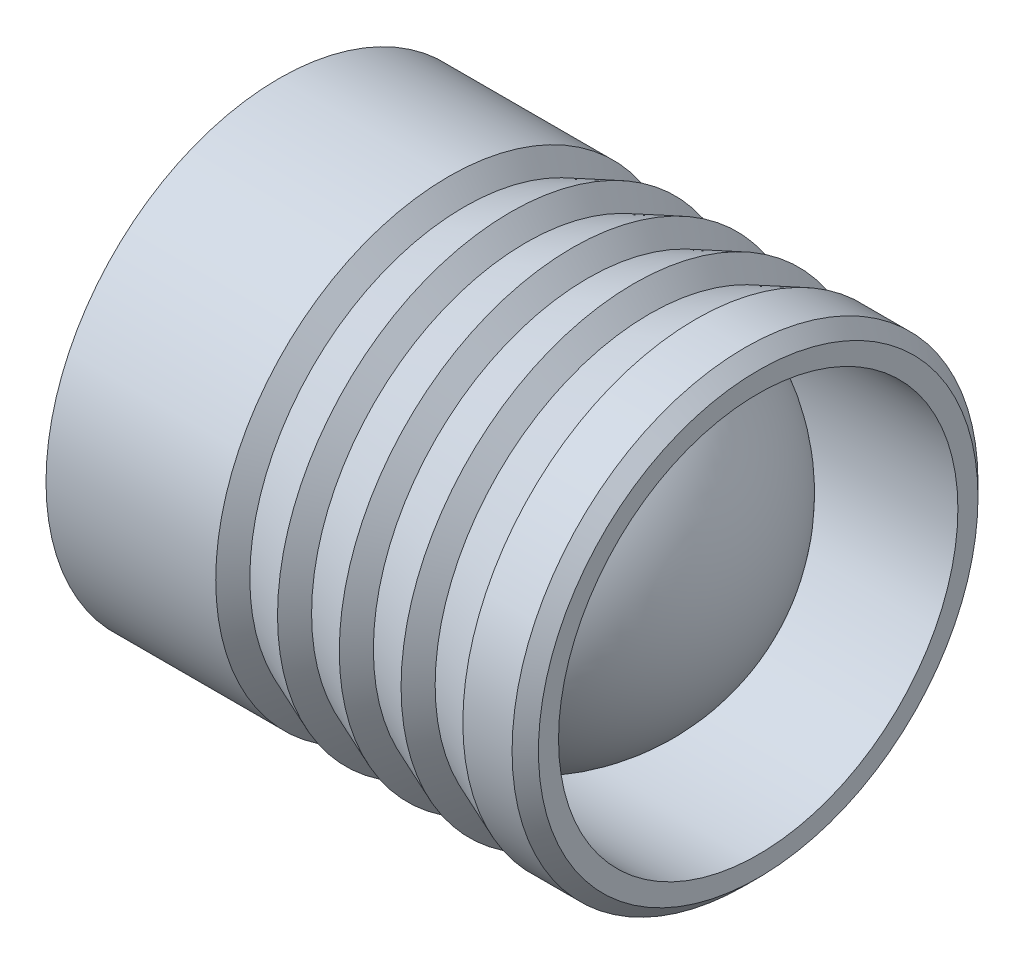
ISO-10303-21;
HEADER;
FILE_DESCRIPTION(('STEP AP214'),'2;1');
FILE_NAME('part.step','',(''),(''),'','','');
FILE_SCHEMA(('AUTOMOTIVE_DESIGN { 1 0 10303 214 1 1 1 1 }'));
ENDSEC;
DATA;
#1=APPLICATION_CONTEXT('core data for automotive mechanical design processes');
#2=APPLICATION_PROTOCOL_DEFINITION('international standard','automotive_design',2000,#1);
#3=PRODUCT_CONTEXT('',#1,'mechanical');
#4=PRODUCT('Part','Part','',(#3));
#5=PRODUCT_RELATED_PRODUCT_CATEGORY('part','',(#4));
#6=PRODUCT_DEFINITION_FORMATION('','',#4);
#7=PRODUCT_DEFINITION_CONTEXT('part definition',#1,'design');
#8=PRODUCT_DEFINITION('design','',#6,#7);
#9=PRODUCT_DEFINITION_SHAPE('','',#8);
#10=(LENGTH_UNIT() NAMED_UNIT(*) SI_UNIT(.MILLI.,.METRE.));
#11=(NAMED_UNIT(*) PLANE_ANGLE_UNIT() SI_UNIT($,.RADIAN.));
#12=(NAMED_UNIT(*) SI_UNIT($,.STERADIAN.) SOLID_ANGLE_UNIT());
#13=UNCERTAINTY_MEASURE_WITH_UNIT(LENGTH_MEASURE(1.E-05),#10,'distance_accuracy_value','');
#14=(GEOMETRIC_REPRESENTATION_CONTEXT(3) GLOBAL_UNCERTAINTY_ASSIGNED_CONTEXT((#13)) GLOBAL_UNIT_ASSIGNED_CONTEXT((#10,
#11,#12)) REPRESENTATION_CONTEXT('',''));
#15=CARTESIAN_POINT('',(0.,0.,0.));
#16=DIRECTION('',(0.,0.,1.));
#17=DIRECTION('',(1.,0.,0.));
#18=AXIS2_PLACEMENT_3D('',#15,#16,#17);
#19=CARTESIAN_POINT('',(4.09,0.,0.));
#20=DIRECTION('',(1.,0.,0.));
#21=DIRECTION('',(0.,-1.,0.));
#22=AXIS2_PLACEMENT_3D('',#19,#20,#21);
#23=SPHERICAL_SURFACE('',#22,3.01);
#24=CARTESIAN_POINT('',(4.33515423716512,0.,0.));
#25=DIRECTION('',(-1.,0.,0.));
#26=DIRECTION('',(0.,0.,1.));
#27=AXIS2_PLACEMENT_3D('',#24,#25,#26);
#28=CIRCLE('',#27,2.9999999);
#29=CARTESIAN_POINT('',(4.33515423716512,0.,2.9999999));
#30=VERTEX_POINT('',#29);
#31=EDGE_CURVE('E41',#30,#30,#28,.T.);
#32=ORIENTED_EDGE('',*,*,#31,.F.);
#33=EDGE_LOOP('',(#32));
#34=FACE_BOUND('',#33,.T.);
#35=CARTESIAN_POINT('',(7.1,0.,0.));
#36=VERTEX_POINT('',#35);
#37=VERTEX_LOOP('',#36);
#38=FACE_BOUND('',#37,.T.);
#39=ADVANCED_FACE('F18',(#34,#38),#23,.T.);
#40=CARTESIAN_POINT('',(7.5,3.30201010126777,0.));
#41=DIRECTION('',(-1.,0.,0.));
#42=DIRECTION('',(0.,0.,1.));
#43=AXIS2_PLACEMENT_3D('',#40,#41,#42);
#44=PLANE('',#43);
#45=CARTESIAN_POINT('',(7.5,0.,0.));
#46=DIRECTION('',(1.,0.,0.));
#47=DIRECTION('',(0.,0.,-1.));
#48=AXIS2_PLACEMENT_3D('',#45,#46,#47);
#49=CIRCLE('',#48,3.3020101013);
#50=CARTESIAN_POINT('',(7.5,0.,-3.30201010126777));
#51=VERTEX_POINT('',#50);
#52=EDGE_CURVE('E11',#51,#51,#49,.T.);
#53=ORIENTED_EDGE('',*,*,#52,.T.);
#54=EDGE_LOOP('',(#53));
#55=FACE_BOUND('',#54,.T.);
#56=CARTESIAN_POINT('',(7.5,0.,0.));
#57=DIRECTION('',(1.,0.,0.));
#58=DIRECTION('',(0.,0.,-1.));
#59=AXIS2_PLACEMENT_3D('',#56,#57,#58);
#60=CIRCLE('',#59,2.9999999);
#61=CARTESIAN_POINT('',(7.5,0.,-2.99999989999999));
#62=VERTEX_POINT('',#61);
#63=EDGE_CURVE('E29',#62,#62,#60,.T.);
#64=ORIENTED_EDGE('',*,*,#63,.F.);
#65=EDGE_LOOP('',(#64));
#66=FACE_BOUND('',#65,.T.);
#67=ADVANCED_FACE('F270',(#55,#66),#44,.F.);
#68=CARTESIAN_POINT('',(7.5,0.,0.));
#69=DIRECTION('',(-1.,0.,0.));
#70=DIRECTION('',(0.,0.,-1.));
#71=AXIS2_PLACEMENT_3D('',#68,#69,#70);
#72=CYLINDRICAL_SURFACE('',#71,2.9999999);
#73=ORIENTED_EDGE('',*,*,#63,.T.);
#74=EDGE_LOOP('',(#73));
#75=FACE_BOUND('',#74,.T.);
#76=ORIENTED_EDGE('',*,*,#31,.T.);
#77=EDGE_LOOP('',(#76));
#78=FACE_BOUND('',#77,.T.);
#79=ADVANCED_FACE('F261',(#75,#78),#72,.F.);
#80=CARTESIAN_POINT('',(0.,0.,0.));
#81=DIRECTION('',(1.,0.,0.));
#82=DIRECTION('',(0.,1.,0.));
#83=AXIS2_PLACEMENT_3D('',#80,#81,#82);
#84=PLANE('',#83);
#85=CARTESIAN_POINT('',(0.,0.,0.));
#86=DIRECTION('',(1.,0.,0.));
#87=DIRECTION('',(0.,0.,-1.));
#88=AXIS2_PLACEMENT_3D('',#85,#86,#87);
#89=CIRCLE('',#88,2.9803847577);
#90=CARTESIAN_POINT('',(0.,0.,-2.98038475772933));
#91=VERTEX_POINT('',#90);
#92=EDGE_CURVE('E144',#91,#91,#89,.T.);
#93=ORIENTED_EDGE('',*,*,#92,.F.);
#94=EDGE_LOOP('',(#93));
#95=FACE_BOUND('',#94,.T.);
#96=ADVANCED_FACE('F258',(#95),#84,.F.);
#97=CARTESIAN_POINT('',(7.30201010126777,0.,0.));
#98=DIRECTION('',(-1.,0.,0.));
#99=DIRECTION('',(0.,0.,1.));
#100=AXIS2_PLACEMENT_3D('',#97,#98,#99);
#101=CONICAL_SURFACE('',#100,3.5,0.7853981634);
#102=CARTESIAN_POINT('',(7.30201010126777,0.,0.));
#103=DIRECTION('',(1.,0.,0.));
#104=DIRECTION('',(0.,0.,-1.));
#105=AXIS2_PLACEMENT_3D('',#102,#103,#104);
#106=CIRCLE('',#105,3.5);
#107=CARTESIAN_POINT('',(7.30201010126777,0.,-3.5));
#108=VERTEX_POINT('',#107);
#109=EDGE_CURVE('E130',#108,#108,#106,.T.);
#110=ORIENTED_EDGE('',*,*,#109,.T.);
#111=EDGE_LOOP('',(#110));
#112=FACE_BOUND('',#111,.T.);
#113=ORIENTED_EDGE('',*,*,#52,.F.);
#114=EDGE_LOOP('',(#113));
#115=FACE_BOUND('',#114,.T.);
#116=ADVANCED_FACE('F254',(#112,#115),#101,.T.);
#117=CARTESIAN_POINT('',(7.5,0.,0.));
#118=DIRECTION('',(-1.,0.,0.));
#119=DIRECTION('',(0.,0.,-1.));
#120=AXIS2_PLACEMENT_3D('',#117,#118,#119);
#121=CYLINDRICAL_SURFACE('',#120,3.5);
#122=CARTESIAN_POINT('',(6.5625,0.,0.));
#123=DIRECTION('',(1.,0.,0.));
#124=DIRECTION('',(0.,0.,-1.));
#125=AXIS2_PLACEMENT_3D('',#122,#123,#124);
#126=CIRCLE('',#125,3.5);
#127=CARTESIAN_POINT('',(6.5625,0.,-3.5));
#128=VERTEX_POINT('',#127);
#129=EDGE_CURVE('E174',#128,#128,#126,.T.);
#130=ORIENTED_EDGE('',*,*,#129,.T.);
#131=EDGE_LOOP('',(#130));
#132=FACE_BOUND('',#131,.T.);
#133=ORIENTED_EDGE('',*,*,#109,.F.);
#134=EDGE_LOOP('',(#133));
#135=FACE_BOUND('',#134,.T.);
#136=ADVANCED_FACE('F257',(#132,#135),#121,.T.);
#137=CARTESIAN_POINT('',(5.86640625,0.,0.));
#138=DIRECTION('',(1.,0.,0.));
#139=DIRECTION('',(0.,0.,-1.));
#140=AXIS2_PLACEMENT_3D('',#137,#138,#139);
#141=CONICAL_SURFACE('',#140,3.22,0.3824399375);
#142=ORIENTED_EDGE('',*,*,#129,.F.);
#143=EDGE_LOOP('',(#142));
#144=FACE_BOUND('',#143,.T.);
#145=CARTESIAN_POINT('',(5.86640625,0.,0.));
#146=DIRECTION('',(1.,0.,0.));
#147=DIRECTION('',(0.,0.,-1.));
#148=AXIS2_PLACEMENT_3D('',#145,#146,#147);
#149=CIRCLE('',#148,3.22);
#150=CARTESIAN_POINT('',(5.86640625,0.,-3.22));
#151=VERTEX_POINT('',#150);
#152=EDGE_CURVE('E124',#151,#151,#149,.T.);
#153=ORIENTED_EDGE('',*,*,#152,.T.);
#154=EDGE_LOOP('',(#153));
#155=FACE_BOUND('',#154,.T.);
#156=ADVANCED_FACE('F265',(#144,#155),#141,.T.);
#157=CARTESIAN_POINT('',(5.634375,0.,0.));
#158=DIRECTION('',(-1.,0.,0.));
#159=DIRECTION('',(0.,0.,1.));
#160=AXIS2_PLACEMENT_3D('',#157,#158,#159);
#161=CONICAL_SURFACE('',#160,3.5,0.8788087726);
#162=CARTESIAN_POINT('',(5.634375,0.,0.));
#163=DIRECTION('',(1.,0.,0.));
#164=DIRECTION('',(0.,0.,-1.));
#165=AXIS2_PLACEMENT_3D('',#162,#163,#164);
#166=CIRCLE('',#165,3.5);
#167=CARTESIAN_POINT('',(5.634375,0.,-3.5));
#168=VERTEX_POINT('',#167);
#169=EDGE_CURVE('E22',#168,#168,#166,.T.);
#170=ORIENTED_EDGE('',*,*,#169,.T.);
#171=EDGE_LOOP('',(#170));
#172=FACE_BOUND('',#171,.T.);
#173=ORIENTED_EDGE('',*,*,#152,.F.);
#174=EDGE_LOOP('',(#173));
#175=FACE_BOUND('',#174,.T.);
#176=ADVANCED_FACE('F268',(#172,#175),#161,.T.);
#177=CARTESIAN_POINT('',(4.93828125,0.,0.));
#178=DIRECTION('',(1.,0.,0.));
#179=DIRECTION('',(0.,0.,-1.));
#180=AXIS2_PLACEMENT_3D('',#177,#178,#179);
#181=CONICAL_SURFACE('',#180,3.22,0.3824399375);
#182=ORIENTED_EDGE('',*,*,#169,.F.);
#183=EDGE_LOOP('',(#182));
#184=FACE_BOUND('',#183,.T.);
#185=CARTESIAN_POINT('',(4.93828125,0.,0.));
#186=DIRECTION('',(1.,0.,0.));
#187=DIRECTION('',(0.,0.,-1.));
#188=AXIS2_PLACEMENT_3D('',#185,#186,#187);
#189=CIRCLE('',#188,3.22);
#190=CARTESIAN_POINT('',(4.93828125,0.,-3.22));
#191=VERTEX_POINT('',#190);
#192=EDGE_CURVE('E113',#191,#191,#189,.T.);
#193=ORIENTED_EDGE('',*,*,#192,.T.);
#194=EDGE_LOOP('',(#193));
#195=FACE_BOUND('',#194,.T.);
#196=ADVANCED_FACE('F299',(#184,#195),#181,.T.);
#197=CARTESIAN_POINT('',(4.70625,0.,0.));
#198=DIRECTION('',(-1.,0.,0.));
#199=DIRECTION('',(0.,0.,1.));
#200=AXIS2_PLACEMENT_3D('',#197,#198,#199);
#201=CONICAL_SURFACE('',#200,3.5,0.8788087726);
#202=CARTESIAN_POINT('',(4.70625,0.,0.));
#203=DIRECTION('',(1.,0.,0.));
#204=DIRECTION('',(0.,0.,-1.));
#205=AXIS2_PLACEMENT_3D('',#202,#203,#204);
#206=CIRCLE('',#205,3.5);
#207=CARTESIAN_POINT('',(4.70625,0.,-3.5));
#208=VERTEX_POINT('',#207);
#209=EDGE_CURVE('E117',#208,#208,#206,.T.);
#210=ORIENTED_EDGE('',*,*,#209,.T.);
#211=EDGE_LOOP('',(#210));
#212=FACE_BOUND('',#211,.T.);
#213=ORIENTED_EDGE('',*,*,#192,.F.);
#214=EDGE_LOOP('',(#213));
#215=FACE_BOUND('',#214,.T.);
#216=ADVANCED_FACE('F114',(#212,#215),#201,.T.);
#217=CARTESIAN_POINT('',(4.01015625,0.,0.));
#218=DIRECTION('',(1.,0.,0.));
#219=DIRECTION('',(0.,0.,-1.));
#220=AXIS2_PLACEMENT_3D('',#217,#218,#219);
#221=CONICAL_SURFACE('',#220,3.22,0.3824399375);
#222=ORIENTED_EDGE('',*,*,#209,.F.);
#223=EDGE_LOOP('',(#222));
#224=FACE_BOUND('',#223,.T.);
#225=CARTESIAN_POINT('',(4.01015625,0.,0.));
#226=DIRECTION('',(1.,0.,0.));
#227=DIRECTION('',(0.,0.,-1.));
#228=AXIS2_PLACEMENT_3D('',#225,#226,#227);
#229=CIRCLE('',#228,3.22);
#230=CARTESIAN_POINT('',(4.01015625,0.,-3.22));
#231=VERTEX_POINT('',#230);
#232=EDGE_CURVE('E127',#231,#231,#229,.T.);
#233=ORIENTED_EDGE('',*,*,#232,.T.);
#234=EDGE_LOOP('',(#233));
#235=FACE_BOUND('',#234,.T.);
#236=ADVANCED_FACE('F295',(#224,#235),#221,.T.);
#237=CARTESIAN_POINT('',(3.778125,0.,0.));
#238=DIRECTION('',(-1.,0.,0.));
#239=DIRECTION('',(0.,0.,1.));
#240=AXIS2_PLACEMENT_3D('',#237,#238,#239);
#241=CONICAL_SURFACE('',#240,3.5,0.8788087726);
#242=CARTESIAN_POINT('',(3.778125,0.,0.));
#243=DIRECTION('',(1.,0.,0.));
#244=DIRECTION('',(0.,0.,-1.));
#245=AXIS2_PLACEMENT_3D('',#242,#243,#244);
#246=CIRCLE('',#245,3.5);
#247=CARTESIAN_POINT('',(3.778125,0.,-3.5));
#248=VERTEX_POINT('',#247);
#249=EDGE_CURVE('E140',#248,#248,#246,.T.);
#250=ORIENTED_EDGE('',*,*,#249,.T.);
#251=EDGE_LOOP('',(#250));
#252=FACE_BOUND('',#251,.T.);
#253=ORIENTED_EDGE('',*,*,#232,.F.);
#254=EDGE_LOOP('',(#253));
#255=FACE_BOUND('',#254,.T.);
#256=ADVANCED_FACE('F293',(#252,#255),#241,.T.);
#257=CARTESIAN_POINT('',(3.08203125,0.,0.));
#258=DIRECTION('',(1.,0.,0.));
#259=DIRECTION('',(0.,0.,-1.));
#260=AXIS2_PLACEMENT_3D('',#257,#258,#259);
#261=CONICAL_SURFACE('',#260,3.22,0.3824399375);
#262=ORIENTED_EDGE('',*,*,#249,.F.);
#263=EDGE_LOOP('',(#262));
#264=FACE_BOUND('',#263,.T.);
#265=CARTESIAN_POINT('',(3.08203125,0.,0.));
#266=DIRECTION('',(1.,0.,0.));
#267=DIRECTION('',(0.,0.,-1.));
#268=AXIS2_PLACEMENT_3D('',#265,#266,#267);
#269=CIRCLE('',#268,3.22);
#270=CARTESIAN_POINT('',(3.08203125,0.,-3.22));
#271=VERTEX_POINT('',#270);
#272=EDGE_CURVE('E134',#271,#271,#269,.T.);
#273=ORIENTED_EDGE('',*,*,#272,.T.);
#274=EDGE_LOOP('',(#273));
#275=FACE_BOUND('',#274,.T.);
#276=ADVANCED_FACE('F283',(#264,#275),#261,.T.);
#277=CARTESIAN_POINT('',(2.85,0.,0.));
#278=DIRECTION('',(-1.,0.,0.));
#279=DIRECTION('',(0.,0.,1.));
#280=AXIS2_PLACEMENT_3D('',#277,#278,#279);
#281=CONICAL_SURFACE('',#280,3.5,0.8788087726);
#282=CARTESIAN_POINT('',(2.85,0.,0.));
#283=DIRECTION('',(1.,0.,0.));
#284=DIRECTION('',(0.,0.,-1.));
#285=AXIS2_PLACEMENT_3D('',#282,#283,#284);
#286=CIRCLE('',#285,3.5);
#287=CARTESIAN_POINT('',(2.85,0.,-3.5));
#288=VERTEX_POINT('',#287);
#289=EDGE_CURVE('E132',#288,#288,#286,.T.);
#290=ORIENTED_EDGE('',*,*,#289,.T.);
#291=EDGE_LOOP('',(#290));
#292=FACE_BOUND('',#291,.T.);
#293=ORIENTED_EDGE('',*,*,#272,.F.);
#294=EDGE_LOOP('',(#293));
#295=FACE_BOUND('',#294,.T.);
#296=ADVANCED_FACE('F276',(#292,#295),#281,.T.);
#297=CARTESIAN_POINT('',(7.5,0.,0.));
#298=DIRECTION('',(-1.,0.,0.));
#299=DIRECTION('',(0.,0.,-1.));
#300=AXIS2_PLACEMENT_3D('',#297,#298,#299);
#301=CYLINDRICAL_SURFACE('',#300,3.5);
#302=CARTESIAN_POINT('',(0.3,0.,0.));
#303=DIRECTION('',(1.,0.,0.));
#304=DIRECTION('',(0.,0.,-1.));
#305=AXIS2_PLACEMENT_3D('',#302,#303,#304);
#306=CIRCLE('',#305,3.5);
#307=CARTESIAN_POINT('',(0.3,0.,-3.5));
#308=VERTEX_POINT('',#307);
#309=EDGE_CURVE('E135',#308,#308,#306,.T.);
#310=ORIENTED_EDGE('',*,*,#309,.T.);
#311=EDGE_LOOP('',(#310));
#312=FACE_BOUND('',#311,.T.);
#313=ORIENTED_EDGE('',*,*,#289,.F.);
#314=EDGE_LOOP('',(#313));
#315=FACE_BOUND('',#314,.T.);
#316=ADVANCED_FACE('F273',(#312,#315),#301,.T.);
#317=CARTESIAN_POINT('',(0.,0.,0.));
#318=DIRECTION('',(1.,0.,0.));
#319=DIRECTION('',(0.,0.,-1.));
#320=AXIS2_PLACEMENT_3D('',#317,#318,#319);
#321=CONICAL_SURFACE('',#320,2.9803847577,1.0471975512);
#322=ORIENTED_EDGE('',*,*,#309,.F.);
#323=EDGE_LOOP('',(#322));
#324=FACE_BOUND('',#323,.T.);
#325=ORIENTED_EDGE('',*,*,#92,.T.);
#326=EDGE_LOOP('',(#325));
#327=FACE_BOUND('',#326,.T.);
#328=ADVANCED_FACE('F275',(#324,#327),#321,.T.);
#329=CLOSED_SHELL('',(#39,#67,#79,#96,#116,#136,#156,#176,#196,#216,#236,#256,#276,#296,#316,#328));
#330=CARTESIAN_POINT('',(2.10705074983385,0.,0.));
#331=DIRECTION('',(1.,0.,0.));
#332=DIRECTION('',(0.,0.,-1.));
#333=AXIS2_PLACEMENT_3D('',#330,#331,#332);
#334=CONICAL_SURFACE('',#333,2.9999999,1.0471975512);
#335=CARTESIAN_POINT('',(2.10705074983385,0.,0.));
#336=DIRECTION('',(1.,0.,0.));
#337=DIRECTION('',(0.,0.,-1.));
#338=AXIS2_PLACEMENT_3D('',#335,#336,#337);
#339=CIRCLE('',#338,2.9999999);
#340=CARTESIAN_POINT('',(2.10705074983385,0.,-2.9999999));
#341=VERTEX_POINT('',#340);
#342=EDGE_CURVE('E152',#341,#341,#339,.T.);
#343=ORIENTED_EDGE('',*,*,#342,.T.);
#344=EDGE_LOOP('',(#343));
#345=FACE_BOUND('',#344,.T.);
#346=CARTESIAN_POINT('',(0.375,0.,0.));
#347=VERTEX_POINT('',#346);
#348=VERTEX_LOOP('',#347);
#349=FACE_BOUND('',#348,.T.);
#350=ADVANCED_FACE('F20',(#345,#349),#334,.F.);
#351=CARTESIAN_POINT('',(4.09,0.,0.));
#352=DIRECTION('',(1.,0.,0.));
#353=DIRECTION('',(0.,-1.,0.));
#354=AXIS2_PLACEMENT_3D('',#351,#352,#353);
#355=SPHERICAL_SURFACE('',#354,3.01);
#356=CARTESIAN_POINT('',(3.84484576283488,0.,0.));
#357=DIRECTION('',(1.,0.,0.));
#358=DIRECTION('',(0.,0.,-1.));
#359=AXIS2_PLACEMENT_3D('',#356,#357,#358);
#360=CIRCLE('',#359,2.9999999);
#361=CARTESIAN_POINT('',(3.84484576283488,0.,-2.9999999));
#362=VERTEX_POINT('',#361);
#363=EDGE_CURVE('E158',#362,#362,#360,.T.);
#364=ORIENTED_EDGE('',*,*,#363,.F.);
#365=EDGE_LOOP('',(#364));
#366=FACE_BOUND('',#365,.T.);
#367=CARTESIAN_POINT('',(1.08,0.,0.));
#368=VERTEX_POINT('',#367);
#369=VERTEX_LOOP('',#368);
#370=FACE_BOUND('',#369,.T.);
#371=ADVANCED_FACE('F196',(#366,#370),#355,.T.);
#372=CARTESIAN_POINT('',(7.5,0.,0.));
#373=DIRECTION('',(-1.,0.,0.));
#374=DIRECTION('',(0.,0.,-1.));
#375=AXIS2_PLACEMENT_3D('',#372,#373,#374);
#376=CYLINDRICAL_SURFACE('',#375,2.9999999);
#377=ORIENTED_EDGE('',*,*,#363,.T.);
#378=EDGE_LOOP('',(#377));
#379=FACE_BOUND('',#378,.T.);
#380=ORIENTED_EDGE('',*,*,#342,.F.);
#381=EDGE_LOOP('',(#380));
#382=FACE_BOUND('',#381,.T.);
#383=ADVANCED_FACE('F193',(#379,#382),#376,.F.);
#384=CLOSED_SHELL('',(#350,#371,#383));
#385=ORIENTED_CLOSED_SHELL('',*,#384,.T.);
#386=BREP_WITH_VOIDS('B1',#329,(#385));
#387=ADVANCED_BREP_SHAPE_REPRESENTATION('',(#18,#386),#14);
#388=SHAPE_DEFINITION_REPRESENTATION(#9,#387);
ENDSEC;
END-ISO-10303-21;
